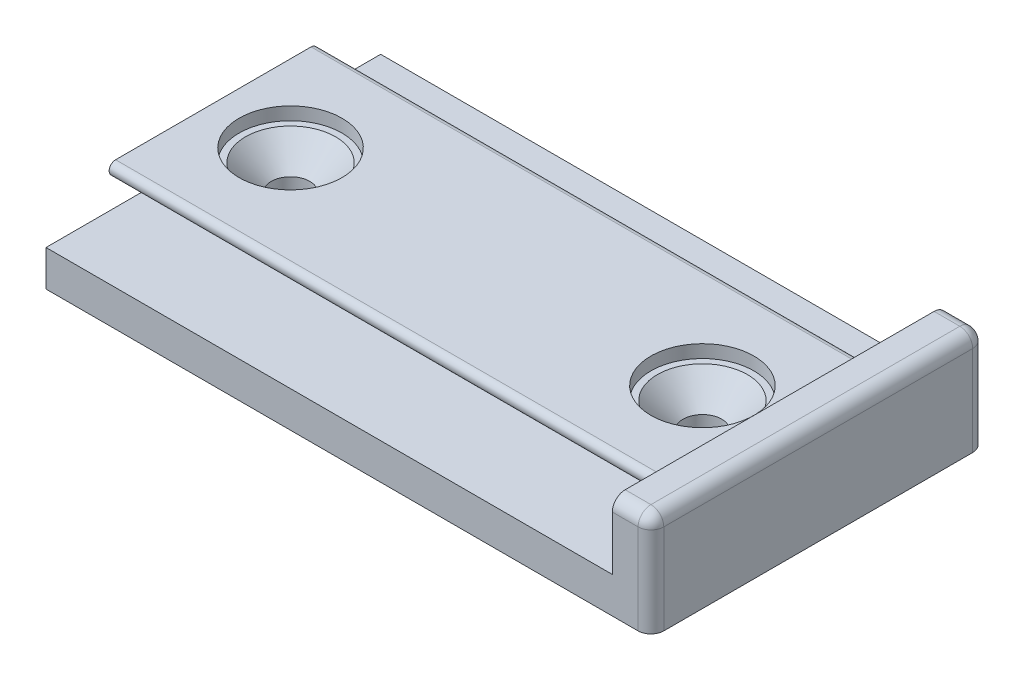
from build123d import *

# Parameters (mm, degrees)
ESQUISSE1_W             = 44
ESQUISSE1_H             = 26
BOSS_EXTRU_1_DEPTH      = 6
ENL_V_MAT_EXTRU_1_DEPTH = 52.458721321
CONG_1_R                = 0.5
ESQUISSE3_R             = 1.5
ENL_V_MAT_EXTRU_2_DEPTH = 10
ESQUISSE3_3_R           = 4
ENL_V_MAT_EXTRU_3_DEPTH = 1
CHANFREIN1_SIZE         = 2
ESQUISSE5_W             = 26
ESQUISSE5_H             = 8
BOSS_EXTRU_2_DEPTH      = 3
CONG_2_R                = 1


with BuildPart() as part:
    # Esquisse1 → Boss.-Extru.1 (new body)
    with BuildSketch(Plane(origin=(0, 0, 0), x_dir=(1, 0, 0), z_dir=(0, 1, 0))):
        with Locations((22, -13)):
            Rectangle(ESQUISSE1_W, ESQUISSE1_H)
    extrude(amount=BOSS_EXTRU_1_DEPTH)

    # Esquisse2 → Enl_v. mat.-Extru.1 (cut, through all)
    with BuildSketch(Plane(origin=(44, 0, 0), x_dir=(0, 0, -1), z_dir=(1, 0, 0))):
        Polygon((-21.8, 6), (-18.6, 2.8), (-26, 2.8), (-26, 6), align=None)
        Polygon((0, 6), (-4.2, 6), (-7.4, 2.8), (0, 2.8), align=None)
    extrude(amount=-ENL_V_MAT_EXTRU_1_DEPTH, mode=Mode.SUBTRACT)

    # Cong_1
    cong_1_edges = [part.edges().sort_by_distance(p)[0] for p in [
        (22, 6, 21.8),
        (22, 6, 4.2),
    ]]
    fillet(cong_1_edges, radius=CONG_1_R)

    # Esquisse3 → Enl_v. mat.-Extru.2 (cut)
    with BuildSketch(Plane(origin=(0, 6, 0), x_dir=(1, 0, 0), z_dir=(0, 1, 0))):
        with Locations(Location((6, -13, 0), (0, 0, 270))):
            Circle(ESQUISSE3_R)
        with Locations(Location((38, -13, 0), (0, 0, 270))):
            Circle(ESQUISSE3_R)
    extrude(amount=-ENL_V_MAT_EXTRU_2_DEPTH, mode=Mode.SUBTRACT)

    # Esquisse3_3 → Enl_v. mat.-Extru.3 (cut)
    with BuildSketch(Plane(origin=(0, 6, 0), x_dir=(1, 0, 0), z_dir=(0, 1, 0))):
        with Locations(Location((38, -13, 0), (0, 0, 270))):
            Circle(ESQUISSE3_3_R)
        with Locations(Location((6, -13, 0), (0, 0, 90))):
            Circle(ESQUISSE3_3_R)
    extrude(amount=-ENL_V_MAT_EXTRU_3_DEPTH, mode=Mode.SUBTRACT)

    # Chanfrein1
    chanfrein1_edges = [part.edges().sort_by_distance(p)[0] for p in [
        (6, 5, 11.5),
        (38, 5, 11.5),
    ]]
    chamfer(chanfrein1_edges, length=CHANFREIN1_SIZE)

    # Esquisse5 → Boss.-Extru.2 (add)
    with BuildSketch(Plane(origin=(44, 0, 0), x_dir=(0, 0, -1), z_dir=(1, 0, 0))):
        with Locations((-13, 4)):
            Rectangle(ESQUISSE5_W, ESQUISSE5_H)
    extrude(amount=BOSS_EXTRU_2_DEPTH)

    # Cong_2
    cong_2_edges = [part.edges().sort_by_distance(p)[0] for p in [
        (45.5, 8, 0),
        (47, 4, 0),
        (47, 8, 13),
        (47, 4, 26),
        (45.5, 8, 26),
    ]]
    fillet(cong_2_edges, radius=CONG_2_R)


solid = part.part
